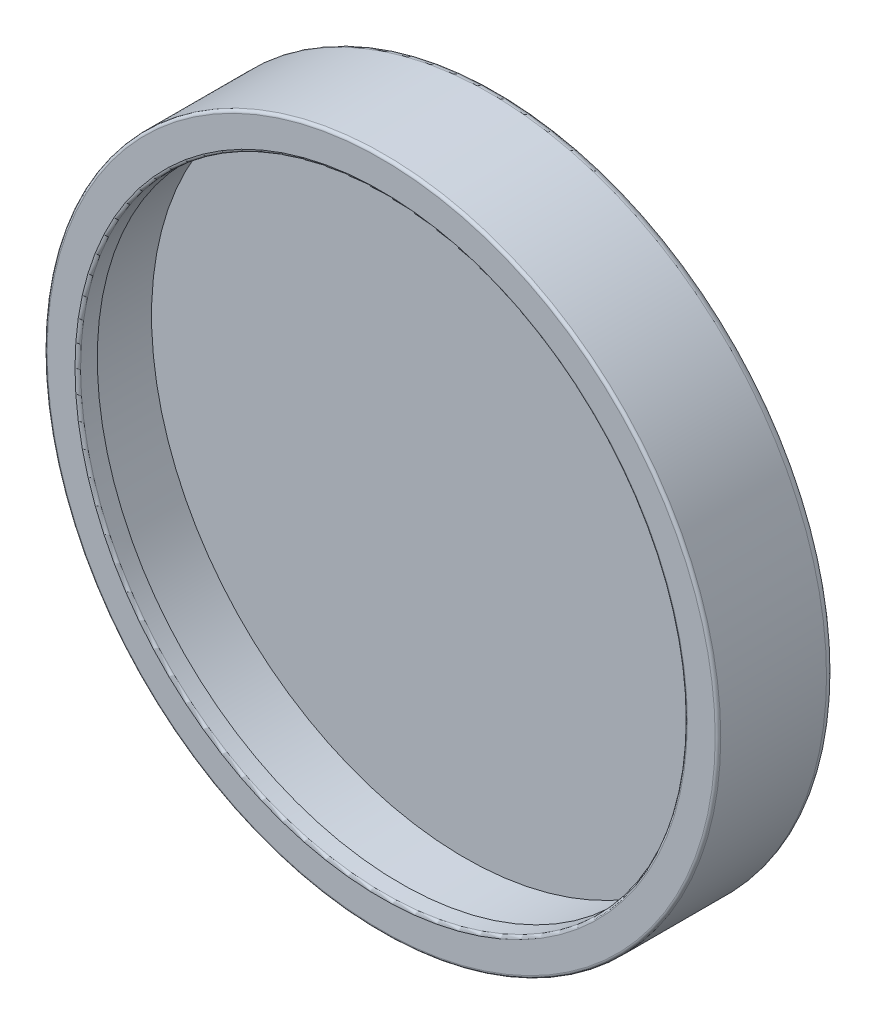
ISO-10303-21;
HEADER;
FILE_DESCRIPTION(('STEP AP214'),'2;1');
FILE_NAME('part.step','',(''),(''),'','','');
FILE_SCHEMA(('AUTOMOTIVE_DESIGN { 1 0 10303 214 1 1 1 1 }'));
ENDSEC;
DATA;
#1=APPLICATION_CONTEXT('core data for automotive mechanical design processes');
#2=APPLICATION_PROTOCOL_DEFINITION('international standard','automotive_design',2000,#1);
#3=PRODUCT_CONTEXT('',#1,'mechanical');
#4=PRODUCT('Part','Part','',(#3));
#5=PRODUCT_RELATED_PRODUCT_CATEGORY('part','',(#4));
#6=PRODUCT_DEFINITION_FORMATION('','',#4);
#7=PRODUCT_DEFINITION_CONTEXT('part definition',#1,'design');
#8=PRODUCT_DEFINITION('design','',#6,#7);
#9=PRODUCT_DEFINITION_SHAPE('','',#8);
#10=(LENGTH_UNIT() NAMED_UNIT(*) SI_UNIT(.MILLI.,.METRE.));
#11=(NAMED_UNIT(*) PLANE_ANGLE_UNIT() SI_UNIT($,.RADIAN.));
#12=(NAMED_UNIT(*) SI_UNIT($,.STERADIAN.) SOLID_ANGLE_UNIT());
#13=UNCERTAINTY_MEASURE_WITH_UNIT(LENGTH_MEASURE(1.E-05),#10,'distance_accuracy_value','');
#14=(GEOMETRIC_REPRESENTATION_CONTEXT(3) GLOBAL_UNCERTAINTY_ASSIGNED_CONTEXT((#13)) GLOBAL_UNIT_ASSIGNED_CONTEXT((#10,
#11,#12)) REPRESENTATION_CONTEXT('',''));
#15=CARTESIAN_POINT('',(0.,0.,0.));
#16=DIRECTION('',(0.,0.,1.));
#17=DIRECTION('',(1.,0.,0.));
#18=AXIS2_PLACEMENT_3D('',#15,#16,#17);
#19=CARTESIAN_POINT('',(0.,0.,1.2));
#20=DIRECTION('',(0.,0.,1.));
#21=DIRECTION('',(1.,0.,0.));
#22=AXIS2_PLACEMENT_3D('',#19,#20,#21);
#23=PLANE('',#22);
#24=CARTESIAN_POINT('',(0.,0.,1.2));
#25=DIRECTION('',(0.,0.,1.));
#26=DIRECTION('',(1.,0.,0.));
#27=AXIS2_PLACEMENT_3D('',#24,#25,#26);
#28=CIRCLE('',#27,11.25);
#29=CARTESIAN_POINT('',(11.25,0.,1.2));
#30=VERTEX_POINT('',#29);
#31=EDGE_CURVE('E177',#30,#30,#28,.T.);
#32=ORIENTED_EDGE('',*,*,#31,.T.);
#33=EDGE_LOOP('',(#32));
#34=FACE_BOUND('',#33,.T.);
#35=ADVANCED_FACE('F16',(#34),#23,.T.);
#36=CARTESIAN_POINT('',(0.,0.,1.2));
#37=DIRECTION('',(0.,0.,1.));
#38=DIRECTION('',(1.,0.,0.));
#39=AXIS2_PLACEMENT_3D('',#36,#37,#38);
#40=CYLINDRICAL_SURFACE('',#39,11.25);
#41=CARTESIAN_POINT('',(0.,0.,3.5));
#42=DIRECTION('',(0.,0.,1.));
#43=DIRECTION('',(1.,0.,0.));
#44=AXIS2_PLACEMENT_3D('',#41,#42,#43);
#45=CIRCLE('',#44,11.25);
#46=CARTESIAN_POINT('',(11.25,0.,3.5));
#47=VERTEX_POINT('',#46);
#48=EDGE_CURVE('E180',#47,#47,#45,.T.);
#49=ORIENTED_EDGE('',*,*,#48,.T.);
#50=EDGE_LOOP('',(#49));
#51=FACE_BOUND('',#50,.T.);
#52=ORIENTED_EDGE('',*,*,#31,.F.);
#53=EDGE_LOOP('',(#52));
#54=FACE_BOUND('',#53,.T.);
#55=ADVANCED_FACE('F88',(#51,#54),#40,.F.);
#56=CARTESIAN_POINT('',(0.,0.,3.5));
#57=DIRECTION('',(0.,0.,1.));
#58=DIRECTION('',(1.,0.,0.));
#59=AXIS2_PLACEMENT_3D('',#56,#57,#58);
#60=PLANE('',#59);
#61=CARTESIAN_POINT('',(0.,0.,3.5));
#62=DIRECTION('',(0.,0.,1.));
#63=DIRECTION('',(1.,0.,0.));
#64=AXIS2_PLACEMENT_3D('',#61,#62,#63);
#65=CIRCLE('',#64,10.9);
#66=CARTESIAN_POINT('',(10.9,0.,3.5));
#67=VERTEX_POINT('',#66);
#68=EDGE_CURVE('E181',#67,#67,#65,.T.);
#69=ORIENTED_EDGE('',*,*,#68,.T.);
#70=EDGE_LOOP('',(#69));
#71=FACE_BOUND('',#70,.T.);
#72=ORIENTED_EDGE('',*,*,#48,.F.);
#73=EDGE_LOOP('',(#72));
#74=FACE_BOUND('',#73,.T.);
#75=ADVANCED_FACE('F85',(#71,#74),#60,.F.);
#76=CARTESIAN_POINT('',(0.,0.,0.));
#77=DIRECTION('',(0.,0.,1.));
#78=DIRECTION('',(1.,0.,0.));
#79=AXIS2_PLACEMENT_3D('',#76,#77,#78);
#80=CYLINDRICAL_SURFACE('',#79,10.9);
#81=ORIENTED_EDGE('',*,*,#68,.F.);
#82=EDGE_LOOP('',(#81));
#83=FACE_BOUND('',#82,.T.);
#84=CARTESIAN_POINT('',(0.,0.,4.1));
#85=DIRECTION('',(0.,0.,1.));
#86=DIRECTION('',(-0.999976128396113,-0.00690960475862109,0.));
#87=AXIS2_PLACEMENT_3D('',#84,#85,#86);
#88=CIRCLE('',#87,10.9);
#89=CARTESIAN_POINT('',(-10.8997397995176,-0.0753146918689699,4.1));
#90=VERTEX_POINT('',#89);
#91=EDGE_CURVE('E55',#90,#90,#88,.F.);
#92=ORIENTED_EDGE('',*,*,#91,.F.);
#93=EDGE_LOOP('',(#92));
#94=FACE_BOUND('',#93,.T.);
#95=ADVANCED_FACE('F78',(#83,#94),#80,.F.);
#96=CARTESIAN_POINT('',(0.,0.,4.1));
#97=DIRECTION('',(0.,0.,1.));
#98=DIRECTION('',(-0.999976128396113,-0.00690960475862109,0.));
#99=AXIS2_PLACEMENT_3D('',#96,#97,#98);
#100=TOROIDAL_SURFACE('',#99,11.,0.1);
#101=ORIENTED_EDGE('',*,*,#91,.T.);
#102=EDGE_LOOP('',(#101));
#103=FACE_BOUND('',#102,.T.);
#104=CARTESIAN_POINT('',(0.,0.,4.2));
#105=DIRECTION('',(0.,0.,1.));
#106=DIRECTION('',(1.,0.,0.));
#107=AXIS2_PLACEMENT_3D('',#104,#105,#106);
#108=CIRCLE('',#107,11.);
#109=CARTESIAN_POINT('',(-11.,0.,4.2));
#110=VERTEX_POINT('',#109);
#111=CARTESIAN_POINT('',(11.,0.,4.2));
#112=VERTEX_POINT('',#111);
#113=EDGE_CURVE('E47',#110,#112,#108,.F.);
#114=ORIENTED_EDGE('',*,*,#113,.F.);
#115=CARTESIAN_POINT('',(0.,0.,4.2));
#116=DIRECTION('',(0.,0.,1.));
#117=DIRECTION('',(-1.,0.,0.));
#118=AXIS2_PLACEMENT_3D('',#115,#116,#117);
#119=CIRCLE('',#118,11.);
#120=EDGE_CURVE('E50',#112,#110,#119,.F.);
#121=ORIENTED_EDGE('',*,*,#120,.F.);
#122=EDGE_LOOP('',(#114,#121));
#123=FACE_BOUND('',#122,.T.);
#124=ADVANCED_FACE('F59',(#103,#123),#100,.T.);
#125=CARTESIAN_POINT('',(0.,0.,4.2));
#126=DIRECTION('',(0.,0.,1.));
#127=DIRECTION('',(1.,0.,0.));
#128=AXIS2_PLACEMENT_3D('',#125,#126,#127);
#129=PLANE('',#128);
#130=ORIENTED_EDGE('',*,*,#120,.T.);
#131=ORIENTED_EDGE('',*,*,#113,.T.);
#132=EDGE_LOOP('',(#130,#131));
#133=FACE_BOUND('',#132,.T.);
#134=CARTESIAN_POINT('',(0.,0.,4.2));
#135=DIRECTION('',(0.,0.,-1.));
#136=DIRECTION('',(1.,0.,0.));
#137=AXIS2_PLACEMENT_3D('',#134,#135,#136);
#138=CIRCLE('',#137,12.);
#139=CARTESIAN_POINT('',(12.,0.,4.2));
#140=VERTEX_POINT('',#139);
#141=CARTESIAN_POINT('',(-12.,0.,4.2));
#142=VERTEX_POINT('',#141);
#143=EDGE_CURVE('E60',#140,#142,#138,.T.);
#144=ORIENTED_EDGE('',*,*,#143,.F.);
#145=CARTESIAN_POINT('',(0.,0.,4.2));
#146=DIRECTION('',(0.,0.,-1.));
#147=DIRECTION('',(-1.,0.,0.));
#148=AXIS2_PLACEMENT_3D('',#145,#146,#147);
#149=CIRCLE('',#148,12.);
#150=EDGE_CURVE('E190',#142,#140,#149,.T.);
#151=ORIENTED_EDGE('',*,*,#150,.F.);
#152=EDGE_LOOP('',(#144,#151));
#153=FACE_BOUND('',#152,.T.);
#154=ADVANCED_FACE('F52',(#133,#153),#129,.T.);
#155=CARTESIAN_POINT('',(0.,0.,4.1));
#156=DIRECTION('',(0.,0.,1.));
#157=DIRECTION('',(0.999990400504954,-0.0043816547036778,0.));
#158=AXIS2_PLACEMENT_3D('',#155,#156,#157);
#159=TOROIDAL_SURFACE('',#158,12.,0.1);
#160=CARTESIAN_POINT('',(0.,0.,4.1));
#161=DIRECTION('',(0.,0.,1.));
#162=DIRECTION('',(1.,0.,0.));
#163=AXIS2_PLACEMENT_3D('',#160,#161,#162);
#164=CIRCLE('',#163,12.1);
#165=CARTESIAN_POINT('',(12.1,0.,4.1));
#166=VERTEX_POINT('',#165);
#167=EDGE_CURVE('E143',#166,#166,#164,.F.);
#168=ORIENTED_EDGE('',*,*,#167,.F.);
#169=EDGE_LOOP('',(#168));
#170=FACE_BOUND('',#169,.T.);
#171=ORIENTED_EDGE('',*,*,#150,.T.);
#172=ORIENTED_EDGE('',*,*,#143,.T.);
#173=EDGE_LOOP('',(#171,#172));
#174=FACE_BOUND('',#173,.T.);
#175=ADVANCED_FACE('F147',(#170,#174),#159,.T.);
#176=CARTESIAN_POINT('',(0.,0.,0.));
#177=DIRECTION('',(0.,0.,1.));
#178=DIRECTION('',(1.,0.,0.));
#179=AXIS2_PLACEMENT_3D('',#176,#177,#178);
#180=CYLINDRICAL_SURFACE('',#179,12.1);
#181=CARTESIAN_POINT('',(0.,0.,0.3));
#182=DIRECTION('',(0.,0.,1.));
#183=DIRECTION('',(-0.999980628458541,-0.00622436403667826,0.));
#184=AXIS2_PLACEMENT_3D('',#181,#182,#183);
#185=CIRCLE('',#184,12.1);
#186=CARTESIAN_POINT('',(-12.0997656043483,-0.075314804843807,0.3));
#187=VERTEX_POINT('',#186);
#188=EDGE_CURVE('E135',#187,#187,#185,.F.);
#189=ORIENTED_EDGE('',*,*,#188,.F.);
#190=EDGE_LOOP('',(#189));
#191=FACE_BOUND('',#190,.T.);
#192=ORIENTED_EDGE('',*,*,#167,.T.);
#193=EDGE_LOOP('',(#192));
#194=FACE_BOUND('',#193,.T.);
#195=ADVANCED_FACE('F108',(#191,#194),#180,.T.);
#196=CARTESIAN_POINT('',(0.,0.,0.3));
#197=DIRECTION('',(0.,0.,1.));
#198=DIRECTION('',(-0.999980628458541,-0.00622436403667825,0.));
#199=AXIS2_PLACEMENT_3D('',#196,#197,#198);
#200=TOROIDAL_SURFACE('',#199,11.8,0.3);
#201=ORIENTED_EDGE('',*,*,#188,.T.);
#202=EDGE_LOOP('',(#201));
#203=FACE_BOUND('',#202,.T.);
#204=CARTESIAN_POINT('',(0.,0.,0.));
#205=DIRECTION('',(0.,0.,1.));
#206=DIRECTION('',(1.,0.,0.));
#207=AXIS2_PLACEMENT_3D('',#204,#205,#206);
#208=CIRCLE('',#207,11.8);
#209=CARTESIAN_POINT('',(11.8,0.,0.));
#210=VERTEX_POINT('',#209);
#211=CARTESIAN_POINT('',(-11.8,0.,0.));
#212=VERTEX_POINT('',#211);
#213=EDGE_CURVE('E11',#210,#212,#208,.T.);
#214=ORIENTED_EDGE('',*,*,#213,.T.);
#215=CARTESIAN_POINT('',(0.,0.,0.));
#216=DIRECTION('',(0.,0.,1.));
#217=DIRECTION('',(-1.,0.,0.));
#218=AXIS2_PLACEMENT_3D('',#215,#216,#217);
#219=CIRCLE('',#218,11.8);
#220=EDGE_CURVE('E27',#212,#210,#219,.T.);
#221=ORIENTED_EDGE('',*,*,#220,.T.);
#222=EDGE_LOOP('',(#214,#221));
#223=FACE_BOUND('',#222,.T.);
#224=ADVANCED_FACE('F102',(#203,#223),#200,.T.);
#225=CARTESIAN_POINT('',(0.,0.,0.));
#226=DIRECTION('',(0.,0.,1.));
#227=DIRECTION('',(1.,0.,0.));
#228=AXIS2_PLACEMENT_3D('',#225,#226,#227);
#229=PLANE('',#228);
#230=ORIENTED_EDGE('',*,*,#220,.F.);
#231=ORIENTED_EDGE('',*,*,#213,.F.);
#232=EDGE_LOOP('',(#230,#231));
#233=FACE_BOUND('',#232,.T.);
#234=ADVANCED_FACE('F100',(#233),#229,.F.);
#235=CLOSED_SHELL('',(#35,#55,#75,#95,#124,#154,#175,#195,#224,#234));
#236=MANIFOLD_SOLID_BREP('B1',#235);
#237=ADVANCED_BREP_SHAPE_REPRESENTATION('',(#18,#236),#14);
#238=SHAPE_DEFINITION_REPRESENTATION(#9,#237);
ENDSEC;
END-ISO-10303-21;
